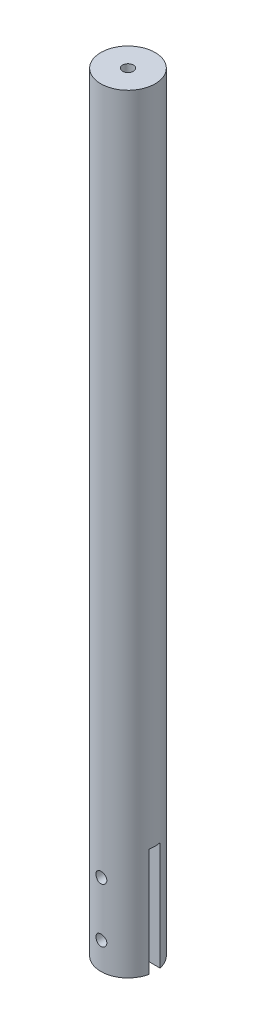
ISO-10303-21;
HEADER;
FILE_DESCRIPTION(('STEP AP214'),'2;1');
FILE_NAME('part.step','',(''),(''),'','','');
FILE_SCHEMA(('AUTOMOTIVE_DESIGN { 1 0 10303 214 1 1 1 1 }'));
ENDSEC;
DATA;
#1=APPLICATION_CONTEXT('core data for automotive mechanical design processes');
#2=APPLICATION_PROTOCOL_DEFINITION('international standard','automotive_design',2000,#1);
#3=PRODUCT_CONTEXT('',#1,'mechanical');
#4=PRODUCT('Part','Part','',(#3));
#5=PRODUCT_RELATED_PRODUCT_CATEGORY('part','',(#4));
#6=PRODUCT_DEFINITION_FORMATION('','',#4);
#7=PRODUCT_DEFINITION_CONTEXT('part definition',#1,'design');
#8=PRODUCT_DEFINITION('design','',#6,#7);
#9=PRODUCT_DEFINITION_SHAPE('','',#8);
#10=(LENGTH_UNIT() NAMED_UNIT(*) SI_UNIT(.MILLI.,.METRE.));
#11=(NAMED_UNIT(*) PLANE_ANGLE_UNIT() SI_UNIT($,.RADIAN.));
#12=(NAMED_UNIT(*) SI_UNIT($,.STERADIAN.) SOLID_ANGLE_UNIT());
#13=UNCERTAINTY_MEASURE_WITH_UNIT(LENGTH_MEASURE(1.E-05),#10,'distance_accuracy_value','');
#14=(GEOMETRIC_REPRESENTATION_CONTEXT(3) GLOBAL_UNCERTAINTY_ASSIGNED_CONTEXT((#13)) GLOBAL_UNIT_ASSIGNED_CONTEXT((#10,
#11,#12)) REPRESENTATION_CONTEXT('',''));
#15=CARTESIAN_POINT('',(0.,0.,0.));
#16=DIRECTION('',(0.,0.,1.));
#17=DIRECTION('',(1.,0.,0.));
#18=AXIS2_PLACEMENT_3D('',#15,#16,#17);
#19=CARTESIAN_POINT('',(0.,0.,0.));
#20=DIRECTION('',(0.,1.,0.));
#21=DIRECTION('',(0.,0.,1.));
#22=AXIS2_PLACEMENT_3D('',#19,#20,#21);
#23=PLANE('',#22);
#24=CARTESIAN_POINT('',(0.,0.,0.));
#25=DIRECTION('',(0.,1.,0.));
#26=DIRECTION('',(0.,0.,1.));
#27=AXIS2_PLACEMENT_3D('',#24,#25,#26);
#28=CIRCLE('',#27,15.);
#29=CARTESIAN_POINT('',(14.6969384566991,0.,-3.));
#30=VERTEX_POINT('',#29);
#31=CARTESIAN_POINT('',(-14.6969384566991,0.,-3.));
#32=VERTEX_POINT('',#31);
#33=EDGE_CURVE('E97',#30,#32,#28,.T.);
#34=ORIENTED_EDGE('',*,*,#33,.F.);
#35=DIRECTION('',(-1.,0.,0.));
#36=VECTOR('',#35,1.);
#37=CARTESIAN_POINT('',(0.,0.,-3.));
#38=LINE('',#37,#36);
#39=EDGE_CURVE('E86',#30,#32,#38,.T.);
#40=ORIENTED_EDGE('',*,*,#39,.T.);
#41=EDGE_LOOP('',(#34,#40));
#42=FACE_BOUND('',#41,.T.);
#43=ADVANCED_FACE('F35',(#42),#23,.F.);
#44=CARTESIAN_POINT('',(0.,425.,0.));
#45=DIRECTION('',(0.,-1.,0.));
#46=DIRECTION('',(0.,0.,-1.));
#47=AXIS2_PLACEMENT_3D('',#44,#45,#46);
#48=CYLINDRICAL_SURFACE('',#47,15.);
#49=CARTESIAN_POINT('',(0.,18.,-15.));
#50=CARTESIAN_POINT('',(-0.166730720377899,17.999993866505,-14.9999969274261));
#51=CARTESIAN_POINT('',(-0.333538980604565,17.9860534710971,-14.9971915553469));
#52=CARTESIAN_POINT('',(-0.662440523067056,17.9307044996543,-14.9862709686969));
#53=CARTESIAN_POINT('',(-0.824529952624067,17.8892741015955,-14.9781515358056));
#54=CARTESIAN_POINT('',(-1.13919091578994,17.7802761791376,-14.9575094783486));
#55=CARTESIAN_POINT('',(-1.2917714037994,17.7127336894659,-14.9449910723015));
#56=CARTESIAN_POINT('',(-1.58342396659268,17.5535032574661,-14.9169119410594));
#57=CARTESIAN_POINT('',(-1.72249684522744,17.4618167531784,-14.9013513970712));
#58=CARTESIAN_POINT('',(-1.9850804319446,17.2555845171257,-14.8686649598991));
#59=CARTESIAN_POINT('',(-2.10838185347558,17.1407749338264,-14.8515223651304));
#60=CARTESIAN_POINT('',(-2.33411026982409,16.8921227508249,-14.8177254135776));
#61=CARTESIAN_POINT('',(-2.43653563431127,16.7582786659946,-14.8010710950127));
#62=CARTESIAN_POINT('',(-2.61849526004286,16.4738514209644,-14.7699732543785));
#63=CARTESIAN_POINT('',(-2.6978128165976,16.3231270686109,-14.7555512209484));
#64=CARTESIAN_POINT('',(-2.82991699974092,16.0101545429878,-14.7307880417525));
#65=CARTESIAN_POINT('',(-2.88270624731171,15.847907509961,-14.7204464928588));
#66=CARTESIAN_POINT('',(-2.95957589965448,15.5187469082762,-14.7051841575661));
#67=CARTESIAN_POINT('',(-2.98402349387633,15.3519223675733,-14.7001941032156));
#68=CARTESIAN_POINT('',(-3.00465638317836,15.016470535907,-14.6959912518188));
#69=CARTESIAN_POINT('',(-3.0008445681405,14.8478434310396,-14.6967778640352));
#70=CARTESIAN_POINT('',(-2.96536371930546,14.516259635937,-14.7039765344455));
#71=CARTESIAN_POINT('',(-2.93411562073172,14.3532557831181,-14.7103035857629));
#72=CARTESIAN_POINT('',(-2.84531365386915,14.034851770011,-14.7277363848));
#73=CARTESIAN_POINT('',(-2.78775852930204,13.879451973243,-14.7388423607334));
#74=CARTESIAN_POINT('',(-2.64757435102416,13.5794542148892,-14.7646685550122));
#75=CARTESIAN_POINT('',(-2.56477845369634,13.4349363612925,-14.7794126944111));
#76=CARTESIAN_POINT('',(-2.37658072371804,13.1616874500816,-14.8108385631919));
#77=CARTESIAN_POINT('',(-2.27117629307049,13.0329582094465,-14.827520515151));
#78=CARTESIAN_POINT('',(-2.03849980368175,12.7925117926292,-14.8613106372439));
#79=CARTESIAN_POINT('',(-1.91086848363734,12.6811422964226,-14.8784210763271));
#80=CARTESIAN_POINT('',(-1.63855507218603,12.4813384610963,-14.9108654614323));
#81=CARTESIAN_POINT('',(-1.49387276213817,12.3929044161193,-14.9261993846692));
#82=CARTESIAN_POINT('',(-1.19117816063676,12.2414174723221,-14.9534007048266));
#83=CARTESIAN_POINT('',(-1.0331454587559,12.1784043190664,-14.9652626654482));
#84=CARTESIAN_POINT('',(-0.708446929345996,12.0799185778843,-14.9841422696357));
#85=CARTESIAN_POINT('',(-0.541782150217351,12.0444426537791,-14.9911605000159));
#86=CARTESIAN_POINT('',(-0.207538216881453,12.0025306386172,-14.999480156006));
#87=CARTESIAN_POINT('',(-0.0400209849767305,11.9956187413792,-15.0008752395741));
#88=CARTESIAN_POINT('',(0.293774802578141,12.0097495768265,-14.9980515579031));
#89=CARTESIAN_POINT('',(0.460053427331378,12.0307907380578,-14.9938331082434));
#90=CARTESIAN_POINT('',(0.785116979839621,12.0998351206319,-14.9803149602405));
#91=CARTESIAN_POINT('',(0.943955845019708,12.1475942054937,-14.9710612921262));
#92=CARTESIAN_POINT('',(1.251370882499,12.2684519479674,-14.948506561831));
#93=CARTESIAN_POINT('',(1.39994628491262,12.3415525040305,-14.9352051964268));
#94=CARTESIAN_POINT('',(1.68462352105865,12.5120474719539,-14.9057973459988));
#95=CARTESIAN_POINT('',(1.82055038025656,12.6097283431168,-14.8896585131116));
#96=CARTESIAN_POINT('',(2.07425405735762,12.8262275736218,-14.8564420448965));
#97=CARTESIAN_POINT('',(2.19202892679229,12.9450481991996,-14.8393643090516));
#98=CARTESIAN_POINT('',(2.40792177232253,13.2026200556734,-14.8058791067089));
#99=CARTESIAN_POINT('',(2.50571310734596,13.341647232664,-14.7894858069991));
#100=CARTESIAN_POINT('',(2.67655626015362,13.63443408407,-14.7595257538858));
#101=CARTESIAN_POINT('',(2.74960906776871,13.7881931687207,-14.7459588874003));
#102=CARTESIAN_POINT('',(2.86845552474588,14.1053047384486,-14.7233022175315));
#103=CARTESIAN_POINT('',(2.91439049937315,14.268602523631,-14.7141892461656));
#104=CARTESIAN_POINT('',(2.97812595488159,14.6008003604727,-14.7014231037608));
#105=CARTESIAN_POINT('',(2.99593010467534,14.769699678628,-14.6977692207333));
#106=CARTESIAN_POINT('',(3.00276273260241,15.105026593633,-14.6963744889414));
#107=CARTESIAN_POINT('',(2.99230736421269,15.271443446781,-14.698527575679));
#108=CARTESIAN_POINT('',(2.94405691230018,15.6000949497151,-14.7082672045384));
#109=CARTESIAN_POINT('',(2.9062620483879,15.7623296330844,-14.7158537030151));
#110=CARTESIAN_POINT('',(2.80463570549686,16.0776831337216,-14.7355579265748));
#111=CARTESIAN_POINT('',(2.74086752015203,16.2308230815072,-14.7476646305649));
#112=CARTESIAN_POINT('',(2.58916393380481,16.5243111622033,-14.7750514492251));
#113=CARTESIAN_POINT('',(2.50122650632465,16.6646582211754,-14.7903318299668));
#114=CARTESIAN_POINT('',(2.30191774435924,16.9311467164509,-14.8226688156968));
#115=CARTESIAN_POINT('',(2.19017366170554,17.0570062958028,-14.839751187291));
#116=CARTESIAN_POINT('',(1.94719310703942,17.2883586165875,-14.8735824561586));
#117=CARTESIAN_POINT('',(1.81595216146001,17.3938466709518,-14.8903312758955));
#118=CARTESIAN_POINT('',(1.53605288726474,17.5825039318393,-14.9218149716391));
#119=CARTESIAN_POINT('',(1.38722665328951,17.6654280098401,-14.9365269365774));
#120=CARTESIAN_POINT('',(1.0774990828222,17.8049583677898,-14.96205375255));
#121=CARTESIAN_POINT('',(0.91660878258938,17.8615883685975,-14.9728721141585));
#122=CARTESIAN_POINT('',(0.629464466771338,17.9359558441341,-14.9872911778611));
#123=CARTESIAN_POINT('',(0.504844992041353,17.9599295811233,-14.9920290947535));
#124=CARTESIAN_POINT('',(0.253498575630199,17.9919537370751,-14.9983846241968));
#125=CARTESIAN_POINT('',(0.126771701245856,18.0000046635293,-15.0000023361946));
#126=CARTESIAN_POINT('',(0.,18.,-15.));
#127=B_SPLINE_CURVE_WITH_KNOTS('',3,(#49,#50,#51,#52,#53,#54,#55,#56,#57,#58,#59,#60,#61,#62,
#63,#64,#65,#66,#67,#68,#69,#70,#71,#72,#73,#74,#75,#76,#77,#78,#79,#80,#81,#82,#83,#84,#85,#86,
#87,#88,#89,#90,#91,#92,#93,#94,#95,#96,#97,#98,#99,#100,#101,#102,#103,#104,#105,#106,#107,
#108,#109,#110,#111,#112,#113,#114,#115,#116,#117,#118,#119,#120,#121,#122,#123,#124,#125,#126),
.UNSPECIFIED.,.T.,.F.,(4,2,2,2,2,2,2,2,2,2,2,2,2,2,2,2,2,2,2,2,2,2,2,2,2,2,2,2,2,2,2,2,2,2,2,2,
2,2,4),(0.,0.499728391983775,0.999853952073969,1.49950120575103,1.99911870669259,
2.50479801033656,3.0105167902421,3.52083585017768,4.03110448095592,4.53468555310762,
5.03821512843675,5.53415181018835,6.03011217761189,6.52942470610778,7.02879464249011,
7.53714757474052,8.04550702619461,8.55465824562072,9.06374777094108,9.56432207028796,
10.064868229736,10.5609136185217,11.0569961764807,11.5591519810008,12.0613616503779,
12.5712188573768,13.081055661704,13.5882114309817,14.0953010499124,14.593191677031,
15.0910783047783,15.5877588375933,16.084481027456,16.5896422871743,17.0949196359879,
17.6054849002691,18.1155886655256,18.4955632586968,18.8755257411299),.UNSPECIFIED.);
#128=CARTESIAN_POINT('',(0.,18.,-15.));
#129=VERTEX_POINT('',#128);
#130=EDGE_CURVE('E111',#129,#129,#127,.T.);
#131=ORIENTED_EDGE('',*,*,#130,.T.);
#132=EDGE_LOOP('',(#131));
#133=FACE_BOUND('',#132,.T.);
#134=CARTESIAN_POINT('',(3.,15.,14.6969384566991));
#135=CARTESIAN_POINT('',(2.99999383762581,14.8333068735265,14.6969417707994));
#136=CARTESIAN_POINT('',(2.98605951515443,14.66653613,14.6998052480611));
#137=CARTESIAN_POINT('',(2.93073685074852,14.3377124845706,14.7109329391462));
#138=CARTESIAN_POINT('',(2.88932654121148,14.1756634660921,14.7192014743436));
#139=CARTESIAN_POINT('',(2.78038734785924,13.8610880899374,14.7401662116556));
#140=CARTESIAN_POINT('',(2.71288444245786,13.7085524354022,14.7528580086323));
#141=CARTESIAN_POINT('',(2.55374732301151,13.4169754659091,14.7812339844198));
#142=CARTESIAN_POINT('',(2.46211445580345,13.2779333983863,14.7969179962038));
#143=CARTESIAN_POINT('',(2.25593722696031,13.0153169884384,14.8297589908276));
#144=CARTESIAN_POINT('',(2.14111696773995,12.8919612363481,14.8469321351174));
#145=CARTESIAN_POINT('',(1.89242036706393,12.6661273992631,14.880674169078));
#146=CARTESIAN_POINT('',(1.75854269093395,12.5636507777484,14.8972430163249));
#147=CARTESIAN_POINT('',(1.47408406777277,12.3816359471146,14.9280838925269));
#148=CARTESIAN_POINT('',(1.32336770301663,12.3023054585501,14.9423346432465));
#149=CARTESIAN_POINT('',(1.01041245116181,12.1701751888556,14.9667521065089));
#150=CARTESIAN_POINT('',(0.848174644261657,12.117372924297,14.9769192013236));
#151=CARTESIAN_POINT('',(0.519050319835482,12.0404784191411,14.9919096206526));
#152=CARTESIAN_POINT('',(0.352253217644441,12.016017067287,14.9968015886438));
#153=CARTESIAN_POINT('',(0.0168557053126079,11.9953471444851,15.0009276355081));
#154=CARTESIAN_POINT('',(-0.15174452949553,11.9991358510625,15.0001622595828));
#155=CARTESIAN_POINT('',(-0.483426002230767,12.0345785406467,14.9931130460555));
#156=CARTESIAN_POINT('',(-0.646551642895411,12.0658349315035,14.9869079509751));
#157=CARTESIAN_POINT('',(-0.965194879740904,12.1546950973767,14.9697653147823));
#158=CARTESIAN_POINT('',(-1.12071217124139,12.2122999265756,14.9588275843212));
#159=CARTESIAN_POINT('',(-1.42085838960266,12.3525901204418,14.9333188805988));
#160=CARTESIAN_POINT('',(-1.5654125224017,12.4354312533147,14.9187254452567));
#161=CARTESIAN_POINT('',(-1.83871513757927,12.6237272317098,14.8875140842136));
#162=CARTESIAN_POINT('',(-1.967461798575,12.7291846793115,14.8708959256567));
#163=CARTESIAN_POINT('',(-2.20785429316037,12.9619008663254,14.8371289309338));
#164=CARTESIAN_POINT('',(-2.31916294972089,13.0895075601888,14.8199758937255));
#165=CARTESIAN_POINT('',(-2.51885547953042,13.3617493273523,14.7873471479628));
#166=CARTESIAN_POINT('',(-2.60723891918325,13.5063847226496,14.7718714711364));
#167=CARTESIAN_POINT('',(-2.75868844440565,13.8090624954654,14.7443414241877));
#168=CARTESIAN_POINT('',(-2.82169994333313,13.967132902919,14.7322944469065));
#169=CARTESIAN_POINT('',(-2.92017102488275,14.291913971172,14.7130942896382));
#170=CARTESIAN_POINT('',(-2.95563419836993,14.4586235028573,14.7059404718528));
#171=CARTESIAN_POINT('',(-2.99749801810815,14.7928945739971,14.6974643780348));
#172=CARTESIAN_POINT('',(-3.00438557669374,14.960392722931,14.6960444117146));
#173=CARTESIAN_POINT('',(-2.99021288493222,15.2941446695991,14.6989345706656));
#174=CARTESIAN_POINT('',(-2.96915421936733,15.4603985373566,14.7032443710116));
#175=CARTESIAN_POINT('',(-2.90010662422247,15.7853059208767,14.7170169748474));
#176=CARTESIAN_POINT('',(-2.85237786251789,15.9440170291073,14.7264299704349));
#177=CARTESIAN_POINT('',(-2.73162310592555,16.2511898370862,14.7493046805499));
#178=CARTESIAN_POINT('',(-2.65859502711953,16.3996506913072,14.7627667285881));
#179=CARTESIAN_POINT('',(-2.48821242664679,16.6842393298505,14.7924421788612));
#180=CARTESIAN_POINT('',(-2.39055323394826,16.8201811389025,14.8086891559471));
#181=CARTESIAN_POINT('',(-2.17408671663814,17.0739249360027,14.8420117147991));
#182=CARTESIAN_POINT('',(-2.05527721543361,17.1917250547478,14.8590873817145));
#183=CARTESIAN_POINT('',(-1.79769682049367,17.4076876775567,14.8924603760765));
#184=CARTESIAN_POINT('',(-1.65864749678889,17.50552096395,14.9087417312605));
#185=CARTESIAN_POINT('',(-1.36580368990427,17.6764376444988,14.9384138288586));
#186=CARTESIAN_POINT('',(-1.21200982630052,17.7495220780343,14.9518046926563));
#187=CARTESIAN_POINT('',(-0.894908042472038,17.8683866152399,14.974118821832));
#188=CARTESIAN_POINT('',(-0.731660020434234,17.9143215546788,14.9830673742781));
#189=CARTESIAN_POINT('',(-0.399568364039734,17.9780737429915,14.9955970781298));
#190=CARTESIAN_POINT('',(-0.230725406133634,17.995894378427,14.9991788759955));
#191=CARTESIAN_POINT('',(0.104618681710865,18.0027809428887,15.0005562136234));
#192=CARTESIAN_POINT('',(0.271109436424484,17.9923418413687,14.9984513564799));
#193=CARTESIAN_POINT('',(0.599913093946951,17.9440981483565,14.9889013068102));
#194=CARTESIAN_POINT('',(0.762226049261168,17.9062939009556,14.9814561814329));
#195=CARTESIAN_POINT('',(1.07775824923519,17.8046130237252,14.9620649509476));
#196=CARTESIAN_POINT('',(1.23099732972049,17.7407958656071,14.9501291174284));
#197=CARTESIAN_POINT('',(1.52466366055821,17.5889632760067,14.9230416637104));
#198=CARTESIAN_POINT('',(1.66508989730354,17.5009459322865,14.9078897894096));
#199=CARTESIAN_POINT('',(1.93159167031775,17.3015418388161,14.8757279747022));
#200=CARTESIAN_POINT('',(2.05739914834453,17.1898009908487,14.858692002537));
#201=CARTESIAN_POINT('',(2.28864785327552,16.9468492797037,14.8248366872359));
#202=CARTESIAN_POINT('',(2.39408424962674,16.8156338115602,14.8080173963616));
#203=CARTESIAN_POINT('',(2.58267665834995,16.5357620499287,14.7763002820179));
#204=CARTESIAN_POINT('',(2.66558044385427,16.3869331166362,14.7614251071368));
#205=CARTESIAN_POINT('',(2.80507214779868,16.0772016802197,14.7355571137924));
#206=CARTESIAN_POINT('',(2.86168393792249,15.9163102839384,14.7245607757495));
#207=CARTESIAN_POINT('',(2.93600741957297,15.6292126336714,14.7098904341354));
#208=CARTESIAN_POINT('',(2.95996169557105,15.5046437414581,14.7050635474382));
#209=CARTESIAN_POINT('',(2.99196005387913,15.2533981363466,14.6985863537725));
#210=CARTESIAN_POINT('',(3.00000468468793,15.1267214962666,14.6969359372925));
#211=CARTESIAN_POINT('',(3.,15.,14.6969384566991));
#212=B_SPLINE_CURVE_WITH_KNOTS('',3,(#134,#135,#136,#137,#138,#139,#140,#141,#142,#143,#144,
#145,#146,#147,#148,#149,#150,#151,#152,#153,#154,#155,#156,#157,#158,#159,#160,#161,#162,#163,
#164,#165,#166,#167,#168,#169,#170,#171,#172,#173,#174,#175,#176,#177,#178,#179,#180,#181,#182,
#183,#184,#185,#186,#187,#188,#189,#190,#191,#192,#193,#194,#195,#196,#197,#198,#199,#200,#201,
#202,#203,#204,#205,#206,#207,#208,#209,#210,#211),.UNSPECIFIED.,.T.,.F.,(4,2,2,2,2,2,2,2,2,2,2,
2,2,2,2,2,2,2,2,2,2,2,2,2,2,2,2,2,2,2,2,2,2,2,2,2,2,2,4),(0.,0.499615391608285,
0.999630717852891,1.49914949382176,1.99864039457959,2.50446757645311,3.01033020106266,
3.52060201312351,4.03082604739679,4.53432746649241,5.03778036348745,5.53406368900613,
6.03036687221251,6.5297977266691,7.02928607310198,7.5374804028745,8.04568434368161,
8.5549758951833,9.06420105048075,9.56471273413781,10.0651960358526,10.5608802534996,
11.056605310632,11.5587917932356,12.0610299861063,12.5709780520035,13.0809046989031,
13.5878944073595,14.0948230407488,14.5929305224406,15.0910317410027,15.5880005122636,
16.0850085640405,16.5900345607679,17.0951801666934,17.6057669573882,18.1158892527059,
18.4957141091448,18.8755258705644),.UNSPECIFIED.);
#213=CARTESIAN_POINT('',(3.,15.,14.6969384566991));
#214=VERTEX_POINT('',#213);
#215=EDGE_CURVE('E118',#214,#214,#212,.T.);
#216=ORIENTED_EDGE('',*,*,#215,.T.);
#217=EDGE_LOOP('',(#216));
#218=FACE_BOUND('',#217,.T.);
#219=CARTESIAN_POINT('',(0.,48.,-15.));
#220=CARTESIAN_POINT('',(-0.1667307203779,47.999993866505,-14.9999969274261));
#221=CARTESIAN_POINT('',(-0.333538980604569,47.9860534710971,-14.9971915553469));
#222=CARTESIAN_POINT('',(-0.662440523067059,47.9307044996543,-14.9862709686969));
#223=CARTESIAN_POINT('',(-0.824529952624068,47.8892741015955,-14.9781515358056));
#224=CARTESIAN_POINT('',(-1.13919091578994,47.7802761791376,-14.9575094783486));
#225=CARTESIAN_POINT('',(-1.2917714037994,47.7127336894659,-14.9449910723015));
#226=CARTESIAN_POINT('',(-1.58342396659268,47.5535032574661,-14.9169119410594));
#227=CARTESIAN_POINT('',(-1.72249684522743,47.4618167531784,-14.9013513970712));
#228=CARTESIAN_POINT('',(-1.98508043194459,47.2555845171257,-14.8686649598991));
#229=CARTESIAN_POINT('',(-2.10838185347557,47.1407749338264,-14.8515223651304));
#230=CARTESIAN_POINT('',(-2.33411026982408,46.8921227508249,-14.8177254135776));
#231=CARTESIAN_POINT('',(-2.43653563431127,46.7582786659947,-14.8010710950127));
#232=CARTESIAN_POINT('',(-2.61849526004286,46.4738514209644,-14.7699732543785));
#233=CARTESIAN_POINT('',(-2.6978128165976,46.3231270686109,-14.7555512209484));
#234=CARTESIAN_POINT('',(-2.82991699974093,46.0101545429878,-14.7307880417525));
#235=CARTESIAN_POINT('',(-2.88270624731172,45.847907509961,-14.7204464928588));
#236=CARTESIAN_POINT('',(-2.95957589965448,45.5187469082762,-14.7051841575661));
#237=CARTESIAN_POINT('',(-2.98402349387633,45.3519223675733,-14.7001941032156));
#238=CARTESIAN_POINT('',(-3.00465638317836,45.016470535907,-14.6959912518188));
#239=CARTESIAN_POINT('',(-3.0008445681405,44.8478434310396,-14.6967778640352));
#240=CARTESIAN_POINT('',(-2.96536371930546,44.516259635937,-14.7039765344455));
#241=CARTESIAN_POINT('',(-2.93411562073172,44.3532557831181,-14.7103035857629));
#242=CARTESIAN_POINT('',(-2.84531365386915,44.034851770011,-14.7277363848));
#243=CARTESIAN_POINT('',(-2.78775852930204,43.879451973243,-14.7388423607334));
#244=CARTESIAN_POINT('',(-2.64757435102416,43.5794542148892,-14.7646685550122));
#245=CARTESIAN_POINT('',(-2.56477845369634,43.4349363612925,-14.7794126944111));
#246=CARTESIAN_POINT('',(-2.37658072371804,43.1616874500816,-14.8108385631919));
#247=CARTESIAN_POINT('',(-2.27117629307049,43.0329582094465,-14.827520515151));
#248=CARTESIAN_POINT('',(-2.03849980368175,42.7925117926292,-14.8613106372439));
#249=CARTESIAN_POINT('',(-1.91086848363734,42.6811422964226,-14.8784210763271));
#250=CARTESIAN_POINT('',(-1.63855507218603,42.4813384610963,-14.9108654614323));
#251=CARTESIAN_POINT('',(-1.49387276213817,42.3929044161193,-14.9261993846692));
#252=CARTESIAN_POINT('',(-1.19117816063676,42.2414174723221,-14.9534007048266));
#253=CARTESIAN_POINT('',(-1.0331454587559,42.1784043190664,-14.9652626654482));
#254=CARTESIAN_POINT('',(-0.708446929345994,42.0799185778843,-14.9841422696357));
#255=CARTESIAN_POINT('',(-0.541782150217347,42.0444426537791,-14.9911605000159));
#256=CARTESIAN_POINT('',(-0.207538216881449,42.0025306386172,-14.999480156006));
#257=CARTESIAN_POINT('',(-0.0400209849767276,41.9956187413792,-15.0008752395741));
#258=CARTESIAN_POINT('',(0.293774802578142,42.0097495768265,-14.9980515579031));
#259=CARTESIAN_POINT('',(0.460053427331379,42.0307907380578,-14.9938331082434));
#260=CARTESIAN_POINT('',(0.785116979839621,42.0998351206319,-14.9803149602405));
#261=CARTESIAN_POINT('',(0.943955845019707,42.1475942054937,-14.9710612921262));
#262=CARTESIAN_POINT('',(1.251370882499,42.2684519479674,-14.948506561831));
#263=CARTESIAN_POINT('',(1.39994628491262,42.3415525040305,-14.9352051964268));
#264=CARTESIAN_POINT('',(1.68462352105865,42.5120474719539,-14.9057973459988));
#265=CARTESIAN_POINT('',(1.82055038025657,42.6097283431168,-14.8896585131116));
#266=CARTESIAN_POINT('',(2.07425405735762,42.8262275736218,-14.8564420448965));
#267=CARTESIAN_POINT('',(2.19202892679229,42.9450481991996,-14.8393643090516));
#268=CARTESIAN_POINT('',(2.40792177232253,43.2026200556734,-14.8058791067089));
#269=CARTESIAN_POINT('',(2.50571310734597,43.341647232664,-14.7894858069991));
#270=CARTESIAN_POINT('',(2.67655626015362,43.63443408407,-14.7595257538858));
#271=CARTESIAN_POINT('',(2.74960906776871,43.7881931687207,-14.7459588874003));
#272=CARTESIAN_POINT('',(2.86845552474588,44.1053047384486,-14.7233022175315));
#273=CARTESIAN_POINT('',(2.91439049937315,44.2686025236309,-14.7141892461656));
#274=CARTESIAN_POINT('',(2.97812595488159,44.6008003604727,-14.7014231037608));
#275=CARTESIAN_POINT('',(2.99593010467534,44.769699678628,-14.6977692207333));
#276=CARTESIAN_POINT('',(3.00276273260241,45.1050265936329,-14.6963744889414));
#277=CARTESIAN_POINT('',(2.99230736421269,45.271443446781,-14.698527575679));
#278=CARTESIAN_POINT('',(2.94405691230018,45.6000949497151,-14.7082672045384));
#279=CARTESIAN_POINT('',(2.9062620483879,45.7623296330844,-14.7158537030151));
#280=CARTESIAN_POINT('',(2.80463570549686,46.0776831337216,-14.7355579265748));
#281=CARTESIAN_POINT('',(2.74086752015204,46.2308230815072,-14.7476646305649));
#282=CARTESIAN_POINT('',(2.58916393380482,46.5243111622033,-14.7750514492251));
#283=CARTESIAN_POINT('',(2.50122650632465,46.6646582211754,-14.7903318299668));
#284=CARTESIAN_POINT('',(2.30191774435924,46.9311467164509,-14.8226688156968));
#285=CARTESIAN_POINT('',(2.19017366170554,47.0570062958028,-14.839751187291));
#286=CARTESIAN_POINT('',(1.94719310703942,47.2883586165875,-14.8735824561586));
#287=CARTESIAN_POINT('',(1.81595216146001,47.3938466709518,-14.8903312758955));
#288=CARTESIAN_POINT('',(1.53605288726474,47.5825039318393,-14.9218149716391));
#289=CARTESIAN_POINT('',(1.38722665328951,47.6654280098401,-14.9365269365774));
#290=CARTESIAN_POINT('',(1.0774990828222,47.8049583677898,-14.96205375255));
#291=CARTESIAN_POINT('',(0.916608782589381,47.8615883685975,-14.9728721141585));
#292=CARTESIAN_POINT('',(0.629464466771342,47.9359558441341,-14.9872911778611));
#293=CARTESIAN_POINT('',(0.504844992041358,47.9599295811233,-14.9920290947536));
#294=CARTESIAN_POINT('',(0.253498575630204,47.9919537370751,-14.9983846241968));
#295=CARTESIAN_POINT('',(0.126771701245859,48.0000046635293,-15.0000023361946));
#296=CARTESIAN_POINT('',(0.,48.,-15.));
#297=B_SPLINE_CURVE_WITH_KNOTS('',3,(#219,#220,#221,#222,#223,#224,#225,#226,#227,#228,#229,
#230,#231,#232,#233,#234,#235,#236,#237,#238,#239,#240,#241,#242,#243,#244,#245,#246,#247,#248,
#249,#250,#251,#252,#253,#254,#255,#256,#257,#258,#259,#260,#261,#262,#263,#264,#265,#266,#267,
#268,#269,#270,#271,#272,#273,#274,#275,#276,#277,#278,#279,#280,#281,#282,#283,#284,#285,#286,
#287,#288,#289,#290,#291,#292,#293,#294,#295,#296),.UNSPECIFIED.,.T.,.F.,(4,2,2,2,2,2,2,2,2,2,2,
2,2,2,2,2,2,2,2,2,2,2,2,2,2,2,2,2,2,2,2,2,2,2,2,2,2,2,4),(0.,0.499728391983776,
0.999853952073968,1.49950120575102,1.99911870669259,2.50479801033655,3.01051679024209,
3.52083585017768,4.03110448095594,4.53468555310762,5.03821512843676,5.53415181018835,
6.03011217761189,6.52942470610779,7.02879464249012,7.53714757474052,8.04550702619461,
8.55465824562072,9.06374777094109,9.56432207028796,10.064868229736,10.5609136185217,
11.0569961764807,11.5591519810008,12.0613616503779,12.5712188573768,13.081055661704,
13.5882114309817,14.0953010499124,14.593191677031,15.0910783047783,15.5877588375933,
16.084481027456,16.5896422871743,17.0949196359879,17.6054849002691,18.1155886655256,
18.4955632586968,18.8755257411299),.UNSPECIFIED.);
#298=CARTESIAN_POINT('',(0.,48.,-15.));
#299=VERTEX_POINT('',#298);
#300=EDGE_CURVE('E151',#299,#299,#297,.T.);
#301=ORIENTED_EDGE('',*,*,#300,.T.);
#302=EDGE_LOOP('',(#301));
#303=FACE_BOUND('',#302,.T.);
#304=CARTESIAN_POINT('',(3.,45.,14.6969384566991));
#305=CARTESIAN_POINT('',(2.99999383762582,44.8333068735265,14.6969417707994));
#306=CARTESIAN_POINT('',(2.98605951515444,44.66653613,14.6998052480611));
#307=CARTESIAN_POINT('',(2.93073685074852,44.3377124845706,14.7109329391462));
#308=CARTESIAN_POINT('',(2.88932654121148,44.1756634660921,14.7192014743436));
#309=CARTESIAN_POINT('',(2.78038734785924,43.8610880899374,14.7401662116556));
#310=CARTESIAN_POINT('',(2.71288444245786,43.7085524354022,14.7528580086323));
#311=CARTESIAN_POINT('',(2.55374732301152,43.4169754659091,14.7812339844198));
#312=CARTESIAN_POINT('',(2.46211445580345,43.2779333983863,14.7969179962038));
#313=CARTESIAN_POINT('',(2.25593722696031,43.0153169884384,14.8297589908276));
#314=CARTESIAN_POINT('',(2.14111696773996,42.8919612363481,14.8469321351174));
#315=CARTESIAN_POINT('',(1.89242036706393,42.6661273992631,14.880674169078));
#316=CARTESIAN_POINT('',(1.75854269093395,42.5636507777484,14.8972430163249));
#317=CARTESIAN_POINT('',(1.47408406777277,42.3816359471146,14.9280838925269));
#318=CARTESIAN_POINT('',(1.32336770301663,42.3023054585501,14.9423346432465));
#319=CARTESIAN_POINT('',(1.01041245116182,42.1701751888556,14.9667521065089));
#320=CARTESIAN_POINT('',(0.84817464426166,42.117372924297,14.9769192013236));
#321=CARTESIAN_POINT('',(0.519050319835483,42.0404784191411,14.9919096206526));
#322=CARTESIAN_POINT('',(0.352253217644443,42.016017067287,14.9968015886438));
#323=CARTESIAN_POINT('',(0.01685570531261,41.9953471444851,15.0009276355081));
#324=CARTESIAN_POINT('',(-0.151744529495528,41.9991358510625,15.0001622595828));
#325=CARTESIAN_POINT('',(-0.483426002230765,42.0345785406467,14.9931130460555));
#326=CARTESIAN_POINT('',(-0.646551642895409,42.0658349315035,14.9869079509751));
#327=CARTESIAN_POINT('',(-0.965194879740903,42.1546950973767,14.9697653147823));
#328=CARTESIAN_POINT('',(-1.12071217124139,42.2122999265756,14.9588275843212));
#329=CARTESIAN_POINT('',(-1.42085838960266,42.3525901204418,14.9333188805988));
#330=CARTESIAN_POINT('',(-1.5654125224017,42.4354312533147,14.9187254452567));
#331=CARTESIAN_POINT('',(-1.83871513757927,42.6237272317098,14.8875140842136));
#332=CARTESIAN_POINT('',(-1.967461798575,42.7291846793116,14.8708959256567));
#333=CARTESIAN_POINT('',(-2.20785429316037,42.9619008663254,14.8371289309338));
#334=CARTESIAN_POINT('',(-2.3191629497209,43.0895075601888,14.8199758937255));
#335=CARTESIAN_POINT('',(-2.51885547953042,43.3617493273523,14.7873471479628));
#336=CARTESIAN_POINT('',(-2.60723891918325,43.5063847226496,14.7718714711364));
#337=CARTESIAN_POINT('',(-2.75868844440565,43.8090624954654,14.7443414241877));
#338=CARTESIAN_POINT('',(-2.82169994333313,43.967132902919,14.7322944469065));
#339=CARTESIAN_POINT('',(-2.92017102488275,44.291913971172,14.7130942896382));
#340=CARTESIAN_POINT('',(-2.95563419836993,44.4586235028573,14.7059404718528));
#341=CARTESIAN_POINT('',(-2.99749801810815,44.7928945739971,14.6974643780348));
#342=CARTESIAN_POINT('',(-3.00438557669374,44.960392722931,14.6960444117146));
#343=CARTESIAN_POINT('',(-2.99021288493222,45.294144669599,14.6989345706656));
#344=CARTESIAN_POINT('',(-2.96915421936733,45.4603985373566,14.7032443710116));
#345=CARTESIAN_POINT('',(-2.90010662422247,45.7853059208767,14.7170169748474));
#346=CARTESIAN_POINT('',(-2.8523778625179,45.9440170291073,14.7264299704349));
#347=CARTESIAN_POINT('',(-2.73162310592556,46.2511898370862,14.7493046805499));
#348=CARTESIAN_POINT('',(-2.65859502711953,46.3996506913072,14.7627667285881));
#349=CARTESIAN_POINT('',(-2.48821242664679,46.6842393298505,14.7924421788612));
#350=CARTESIAN_POINT('',(-2.39055323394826,46.8201811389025,14.8086891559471));
#351=CARTESIAN_POINT('',(-2.17408671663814,47.0739249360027,14.8420117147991));
#352=CARTESIAN_POINT('',(-2.05527721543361,47.1917250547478,14.8590873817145));
#353=CARTESIAN_POINT('',(-1.79769682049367,47.4076876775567,14.8924603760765));
#354=CARTESIAN_POINT('',(-1.65864749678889,47.50552096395,14.9087417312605));
#355=CARTESIAN_POINT('',(-1.36580368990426,47.6764376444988,14.9384138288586));
#356=CARTESIAN_POINT('',(-1.21200982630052,47.7495220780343,14.9518046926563));
#357=CARTESIAN_POINT('',(-0.894908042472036,47.8683866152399,14.974118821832));
#358=CARTESIAN_POINT('',(-0.731660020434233,47.9143215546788,14.9830673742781));
#359=CARTESIAN_POINT('',(-0.399568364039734,47.9780737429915,14.9955970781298));
#360=CARTESIAN_POINT('',(-0.230725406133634,47.995894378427,14.9991788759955));
#361=CARTESIAN_POINT('',(0.104618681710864,48.0027809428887,15.0005562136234));
#362=CARTESIAN_POINT('',(0.271109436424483,47.9923418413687,14.9984513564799));
#363=CARTESIAN_POINT('',(0.599913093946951,47.9440981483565,14.9889013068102));
#364=CARTESIAN_POINT('',(0.762226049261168,47.9062939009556,14.9814561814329));
#365=CARTESIAN_POINT('',(1.0777582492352,47.8046130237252,14.9620649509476));
#366=CARTESIAN_POINT('',(1.23099732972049,47.7407958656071,14.9501291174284));
#367=CARTESIAN_POINT('',(1.52466366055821,47.5889632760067,14.9230416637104));
#368=CARTESIAN_POINT('',(1.66508989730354,47.5009459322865,14.9078897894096));
#369=CARTESIAN_POINT('',(1.93159167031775,47.3015418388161,14.8757279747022));
#370=CARTESIAN_POINT('',(2.05739914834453,47.1898009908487,14.858692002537));
#371=CARTESIAN_POINT('',(2.28864785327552,46.9468492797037,14.8248366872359));
#372=CARTESIAN_POINT('',(2.39408424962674,46.8156338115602,14.8080173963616));
#373=CARTESIAN_POINT('',(2.58267665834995,46.5357620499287,14.7763002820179));
#374=CARTESIAN_POINT('',(2.66558044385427,46.3869331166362,14.7614251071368));
#375=CARTESIAN_POINT('',(2.80507214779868,46.0772016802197,14.7355571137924));
#376=CARTESIAN_POINT('',(2.86168393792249,45.9163102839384,14.7245607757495));
#377=CARTESIAN_POINT('',(2.93600741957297,45.6292126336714,14.7098904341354));
#378=CARTESIAN_POINT('',(2.95996169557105,45.5046437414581,14.7050635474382));
#379=CARTESIAN_POINT('',(2.99196005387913,45.2533981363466,14.6985863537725));
#380=CARTESIAN_POINT('',(3.00000468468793,45.1267214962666,14.6969359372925));
#381=CARTESIAN_POINT('',(3.,45.,14.6969384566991));
#382=B_SPLINE_CURVE_WITH_KNOTS('',3,(#304,#305,#306,#307,#308,#309,#310,#311,#312,#313,#314,
#315,#316,#317,#318,#319,#320,#321,#322,#323,#324,#325,#326,#327,#328,#329,#330,#331,#332,#333,
#334,#335,#336,#337,#338,#339,#340,#341,#342,#343,#344,#345,#346,#347,#348,#349,#350,#351,#352,
#353,#354,#355,#356,#357,#358,#359,#360,#361,#362,#363,#364,#365,#366,#367,#368,#369,#370,#371,
#372,#373,#374,#375,#376,#377,#378,#379,#380,#381),.UNSPECIFIED.,.T.,.F.,(4,2,2,2,2,2,2,2,2,2,2,
2,2,2,2,2,2,2,2,2,2,2,2,2,2,2,2,2,2,2,2,2,2,2,2,2,2,2,4),(0.,0.499615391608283,
0.999630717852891,1.49914949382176,1.99864039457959,2.5044675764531,3.01033020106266,
3.52060201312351,4.0308260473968,4.53432746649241,5.03778036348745,5.53406368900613,
6.03036687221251,6.5297977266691,7.02928607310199,7.5374804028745,8.04568434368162,
8.55497589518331,9.06420105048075,9.56471273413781,10.0651960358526,10.5608802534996,
11.056605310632,11.5587917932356,12.0610299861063,12.5709780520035,13.0809046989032,
13.5878944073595,14.0948230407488,14.5929305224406,15.0910317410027,15.5880005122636,
16.0850085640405,16.5900345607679,17.0951801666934,17.6057669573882,18.115889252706,
18.4957141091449,18.8755258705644),.UNSPECIFIED.);
#383=CARTESIAN_POINT('',(3.,45.,14.6969384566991));
#384=VERTEX_POINT('',#383);
#385=EDGE_CURVE('E115',#384,#384,#382,.T.);
#386=ORIENTED_EDGE('',*,*,#385,.T.);
#387=EDGE_LOOP('',(#386));
#388=FACE_BOUND('',#387,.T.);
#389=CARTESIAN_POINT('',(0.,60.,0.));
#390=DIRECTION('',(0.,1.,0.));
#391=DIRECTION('',(0.,0.,1.));
#392=AXIS2_PLACEMENT_3D('',#389,#390,#391);
#393=CIRCLE('',#392,15.);
#394=CARTESIAN_POINT('',(14.6969384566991,60.,3.));
#395=VERTEX_POINT('',#394);
#396=CARTESIAN_POINT('',(14.6969384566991,60.,-3.));
#397=VERTEX_POINT('',#396);
#398=EDGE_CURVE('E11',#395,#397,#393,.T.);
#399=ORIENTED_EDGE('',*,*,#398,.T.);
#400=DIRECTION('',(0.,-1.,0.));
#401=VECTOR('',#400,1.);
#402=CARTESIAN_POINT('',(14.6969384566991,425.,-3.));
#403=LINE('',#402,#401);
#404=EDGE_CURVE('E61',#397,#30,#403,.T.);
#405=ORIENTED_EDGE('',*,*,#404,.T.);
#406=ORIENTED_EDGE('',*,*,#33,.T.);
#407=DIRECTION('',(0.,-1.,0.));
#408=VECTOR('',#407,1.);
#409=CARTESIAN_POINT('',(-14.6969384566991,425.,-3.));
#410=LINE('',#409,#408);
#411=CARTESIAN_POINT('',(-14.6969384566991,60.,-3.));
#412=VERTEX_POINT('',#411);
#413=EDGE_CURVE('E94',#32,#412,#410,.F.);
#414=ORIENTED_EDGE('',*,*,#413,.T.);
#415=CARTESIAN_POINT('',(-14.6969384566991,60.,3.));
#416=VERTEX_POINT('',#415);
#417=EDGE_CURVE('E45',#412,#416,#393,.T.);
#418=ORIENTED_EDGE('',*,*,#417,.T.);
#419=DIRECTION('',(0.,-1.,0.));
#420=VECTOR('',#419,1.);
#421=CARTESIAN_POINT('',(-14.6969384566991,425.,3.));
#422=LINE('',#421,#420);
#423=CARTESIAN_POINT('',(-14.6969384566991,0.,3.));
#424=VERTEX_POINT('',#423);
#425=EDGE_CURVE('E81',#416,#424,#422,.T.);
#426=ORIENTED_EDGE('',*,*,#425,.T.);
#427=CARTESIAN_POINT('',(14.6969384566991,0.,3.));
#428=VERTEX_POINT('',#427);
#429=EDGE_CURVE('E92',#424,#428,#28,.T.);
#430=ORIENTED_EDGE('',*,*,#429,.T.);
#431=DIRECTION('',(0.,-1.,0.));
#432=VECTOR('',#431,1.);
#433=CARTESIAN_POINT('',(14.6969384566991,425.,3.));
#434=LINE('',#433,#432);
#435=EDGE_CURVE('E53',#428,#395,#434,.F.);
#436=ORIENTED_EDGE('',*,*,#435,.T.);
#437=EDGE_LOOP('',(#399,#405,#406,#414,#418,#426,#430,#436));
#438=FACE_BOUND('',#437,.T.);
#439=CARTESIAN_POINT('',(0.,425.,0.));
#440=DIRECTION('',(0.,1.,0.));
#441=DIRECTION('',(0.,0.,1.));
#442=AXIS2_PLACEMENT_3D('',#439,#440,#441);
#443=CIRCLE('',#442,15.);
#444=CARTESIAN_POINT('',(0.,425.,15.));
#445=VERTEX_POINT('',#444);
#446=EDGE_CURVE('E87',#445,#445,#443,.T.);
#447=ORIENTED_EDGE('',*,*,#446,.F.);
#448=EDGE_LOOP('',(#447));
#449=FACE_BOUND('',#448,.T.);
#450=ADVANCED_FACE('F37',(#133,#218,#303,#388,#438,#449),#48,.T.);
#451=CARTESIAN_POINT('',(0.,425.,0.));
#452=DIRECTION('',(0.,1.,0.));
#453=DIRECTION('',(0.,0.,1.));
#454=AXIS2_PLACEMENT_3D('',#451,#452,#453);
#455=PLANE('',#454);
#456=CARTESIAN_POINT('',(0.,425.,0.));
#457=DIRECTION('',(0.,1.,0.));
#458=DIRECTION('',(0.,0.,1.));
#459=AXIS2_PLACEMENT_3D('',#456,#457,#458);
#460=CIRCLE('',#459,3.);
#461=CARTESIAN_POINT('',(0.,425.,3.));
#462=VERTEX_POINT('',#461);
#463=EDGE_CURVE('E102',#462,#462,#460,.T.);
#464=ORIENTED_EDGE('',*,*,#463,.F.);
#465=EDGE_LOOP('',(#464));
#466=FACE_BOUND('',#465,.T.);
#467=ORIENTED_EDGE('',*,*,#446,.T.);
#468=EDGE_LOOP('',(#467));
#469=FACE_BOUND('',#468,.T.);
#470=ADVANCED_FACE('F167',(#466,#469),#455,.T.);
#471=ORIENTED_EDGE('',*,*,#429,.F.);
#472=DIRECTION('',(1.,0.,0.));
#473=VECTOR('',#472,1.);
#474=CARTESIAN_POINT('',(0.,0.,3.));
#475=LINE('',#474,#473);
#476=EDGE_CURVE('E78',#424,#428,#475,.T.);
#477=ORIENTED_EDGE('',*,*,#476,.T.);
#478=EDGE_LOOP('',(#471,#477));
#479=FACE_BOUND('',#478,.T.);
#480=ADVANCED_FACE('F96',(#479),#23,.F.);
#481=CARTESIAN_POINT('',(0.,395.,0.));
#482=DIRECTION('',(0.,1.,0.));
#483=DIRECTION('',(0.,0.,1.));
#484=AXIS2_PLACEMENT_3D('',#481,#482,#483);
#485=CYLINDRICAL_SURFACE('',#484,3.);
#486=CARTESIAN_POINT('',(0.,395.,0.));
#487=DIRECTION('',(0.,1.,0.));
#488=DIRECTION('',(0.,0.,1.));
#489=AXIS2_PLACEMENT_3D('',#486,#487,#488);
#490=CIRCLE('',#489,3.);
#491=CARTESIAN_POINT('',(0.,395.,3.));
#492=VERTEX_POINT('',#491);
#493=EDGE_CURVE('E98',#492,#492,#490,.T.);
#494=ORIENTED_EDGE('',*,*,#493,.F.);
#495=EDGE_LOOP('',(#494));
#496=FACE_BOUND('',#495,.T.);
#497=ORIENTED_EDGE('',*,*,#463,.T.);
#498=EDGE_LOOP('',(#497));
#499=FACE_BOUND('',#498,.T.);
#500=ADVANCED_FACE('F165',(#496,#499),#485,.F.);
#501=CARTESIAN_POINT('',(0.,395.,0.));
#502=DIRECTION('',(0.,1.,0.));
#503=DIRECTION('',(0.,0.,1.));
#504=AXIS2_PLACEMENT_3D('',#501,#502,#503);
#505=PLANE('',#504);
#506=ORIENTED_EDGE('',*,*,#493,.T.);
#507=EDGE_LOOP('',(#506));
#508=FACE_BOUND('',#507,.T.);
#509=ADVANCED_FACE('F200',(#508),#505,.T.);
#510=CARTESIAN_POINT('',(0.,60.,0.));
#511=DIRECTION('',(0.,1.,0.));
#512=DIRECTION('',(0.,0.,1.));
#513=AXIS2_PLACEMENT_3D('',#510,#511,#512);
#514=PLANE('',#513);
#515=DIRECTION('',(-1.,0.,0.));
#516=VECTOR('',#515,1.);
#517=CARTESIAN_POINT('',(-26.1049703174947,60.,3.));
#518=LINE('',#517,#516);
#519=EDGE_CURVE('E156',#395,#416,#518,.T.);
#520=ORIENTED_EDGE('',*,*,#519,.T.);
#521=ORIENTED_EDGE('',*,*,#417,.F.);
#522=DIRECTION('',(1.,0.,0.));
#523=VECTOR('',#522,1.);
#524=CARTESIAN_POINT('',(-26.1049703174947,60.,-3.));
#525=LINE('',#524,#523);
#526=EDGE_CURVE('E158',#412,#397,#525,.T.);
#527=ORIENTED_EDGE('',*,*,#526,.T.);
#528=ORIENTED_EDGE('',*,*,#398,.F.);
#529=EDGE_LOOP('',(#520,#521,#527,#528));
#530=FACE_BOUND('',#529,.T.);
#531=ADVANCED_FACE('F145',(#530),#514,.F.);
#532=CARTESIAN_POINT('',(-26.1049703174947,60.,-3.));
#533=DIRECTION('',(0.,0.,-1.));
#534=DIRECTION('',(-1.,0.,0.));
#535=AXIS2_PLACEMENT_3D('',#532,#533,#534);
#536=PLANE('',#535);
#537=CARTESIAN_POINT('',(0.,15.,-3.));
#538=DIRECTION('',(0.,0.,-1.));
#539=DIRECTION('',(-1.,0.,0.));
#540=AXIS2_PLACEMENT_3D('',#537,#538,#539);
#541=CIRCLE('',#540,3.);
#542=CARTESIAN_POINT('',(-3.,15.,-3.));
#543=VERTEX_POINT('',#542);
#544=EDGE_CURVE('E123',#543,#543,#541,.T.);
#545=ORIENTED_EDGE('',*,*,#544,.T.);
#546=EDGE_LOOP('',(#545));
#547=FACE_BOUND('',#546,.T.);
#548=CARTESIAN_POINT('',(0.,45.,-3.));
#549=DIRECTION('',(0.,0.,-1.));
#550=DIRECTION('',(-1.,0.,0.));
#551=AXIS2_PLACEMENT_3D('',#548,#549,#550);
#552=CIRCLE('',#551,3.);
#553=CARTESIAN_POINT('',(-3.,45.,-3.));
#554=VERTEX_POINT('',#553);
#555=EDGE_CURVE('E110',#554,#554,#552,.T.);
#556=ORIENTED_EDGE('',*,*,#555,.T.);
#557=EDGE_LOOP('',(#556));
#558=FACE_BOUND('',#557,.T.);
#559=ORIENTED_EDGE('',*,*,#526,.F.);
#560=ORIENTED_EDGE('',*,*,#413,.F.);
#561=ORIENTED_EDGE('',*,*,#39,.F.);
#562=ORIENTED_EDGE('',*,*,#404,.F.);
#563=EDGE_LOOP('',(#559,#560,#561,#562));
#564=FACE_BOUND('',#563,.T.);
#565=ADVANCED_FACE('F191',(#547,#558,#564),#536,.F.);
#566=CARTESIAN_POINT('',(-26.1049703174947,60.,3.));
#567=DIRECTION('',(0.,0.,1.));
#568=DIRECTION('',(1.,0.,0.));
#569=AXIS2_PLACEMENT_3D('',#566,#567,#568);
#570=PLANE('',#569);
#571=CARTESIAN_POINT('',(0.,15.,3.));
#572=DIRECTION('',(0.,0.,1.));
#573=DIRECTION('',(1.,0.,0.));
#574=AXIS2_PLACEMENT_3D('',#571,#572,#573);
#575=CIRCLE('',#574,3.);
#576=CARTESIAN_POINT('',(3.,15.,3.));
#577=VERTEX_POINT('',#576);
#578=EDGE_CURVE('E40',#577,#577,#575,.T.);
#579=ORIENTED_EDGE('',*,*,#578,.T.);
#580=EDGE_LOOP('',(#579));
#581=FACE_BOUND('',#580,.T.);
#582=CARTESIAN_POINT('',(0.,45.,3.));
#583=DIRECTION('',(0.,0.,1.));
#584=DIRECTION('',(1.,0.,0.));
#585=AXIS2_PLACEMENT_3D('',#582,#583,#584);
#586=CIRCLE('',#585,3.);
#587=CARTESIAN_POINT('',(3.,45.,3.));
#588=VERTEX_POINT('',#587);
#589=EDGE_CURVE('E108',#588,#588,#586,.T.);
#590=ORIENTED_EDGE('',*,*,#589,.T.);
#591=EDGE_LOOP('',(#590));
#592=FACE_BOUND('',#591,.T.);
#593=ORIENTED_EDGE('',*,*,#519,.F.);
#594=ORIENTED_EDGE('',*,*,#435,.F.);
#595=ORIENTED_EDGE('',*,*,#476,.F.);
#596=ORIENTED_EDGE('',*,*,#425,.F.);
#597=EDGE_LOOP('',(#593,#594,#595,#596));
#598=FACE_BOUND('',#597,.T.);
#599=ADVANCED_FACE('F80',(#581,#592,#598),#570,.F.);
#600=CARTESIAN_POINT('',(0.,45.,-15.));
#601=DIRECTION('',(0.,0.,1.));
#602=DIRECTION('',(1.,0.,0.));
#603=AXIS2_PLACEMENT_3D('',#600,#601,#602);
#604=CYLINDRICAL_SURFACE('',#603,3.);
#605=ORIENTED_EDGE('',*,*,#589,.F.);
#606=EDGE_LOOP('',(#605));
#607=FACE_BOUND('',#606,.T.);
#608=ORIENTED_EDGE('',*,*,#385,.F.);
#609=EDGE_LOOP('',(#608));
#610=FACE_BOUND('',#609,.T.);
#611=ADVANCED_FACE('F143',(#607,#610),#604,.F.);
#612=ORIENTED_EDGE('',*,*,#555,.F.);
#613=EDGE_LOOP('',(#612));
#614=FACE_BOUND('',#613,.T.);
#615=ORIENTED_EDGE('',*,*,#300,.F.);
#616=EDGE_LOOP('',(#615));
#617=FACE_BOUND('',#616,.T.);
#618=ADVANCED_FACE('F138',(#614,#617),#604,.F.);
#619=CARTESIAN_POINT('',(0.,15.,-15.));
#620=DIRECTION('',(0.,0.,1.));
#621=DIRECTION('',(1.,0.,0.));
#622=AXIS2_PLACEMENT_3D('',#619,#620,#621);
#623=CYLINDRICAL_SURFACE('',#622,3.);
#624=ORIENTED_EDGE('',*,*,#578,.F.);
#625=EDGE_LOOP('',(#624));
#626=FACE_BOUND('',#625,.T.);
#627=ORIENTED_EDGE('',*,*,#215,.F.);
#628=EDGE_LOOP('',(#627));
#629=FACE_BOUND('',#628,.T.);
#630=ADVANCED_FACE('F136',(#626,#629),#623,.F.);
#631=ORIENTED_EDGE('',*,*,#544,.F.);
#632=EDGE_LOOP('',(#631));
#633=FACE_BOUND('',#632,.T.);
#634=ORIENTED_EDGE('',*,*,#130,.F.);
#635=EDGE_LOOP('',(#634));
#636=FACE_BOUND('',#635,.T.);
#637=ADVANCED_FACE('F132',(#633,#636),#623,.F.);
#638=CLOSED_SHELL('',(#43,#450,#470,#480,#500,#509,#531,#565,#599,#611,#618,#630,#637));
#639=MANIFOLD_SOLID_BREP('B2',#638);
#640=ADVANCED_BREP_SHAPE_REPRESENTATION('',(#18,#639),#14);
#641=SHAPE_DEFINITION_REPRESENTATION(#9,#640);
ENDSEC;
END-ISO-10303-21;
